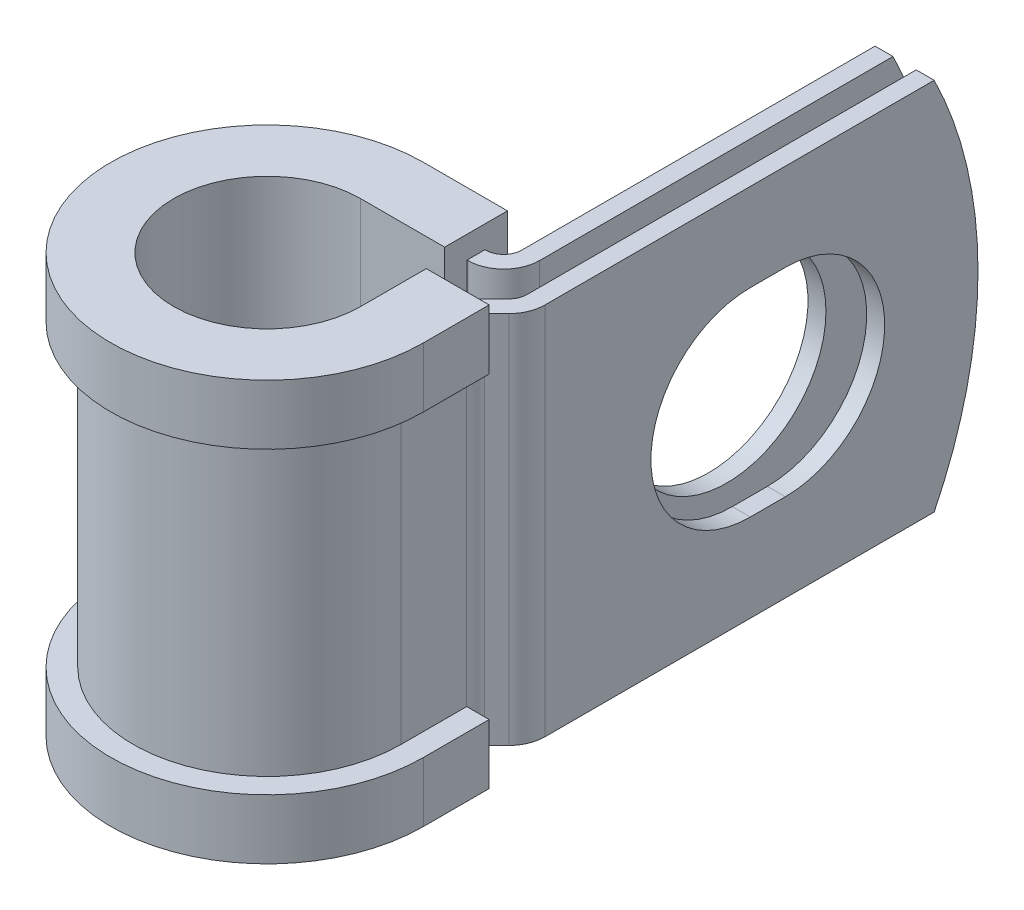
ISO-10303-21;
HEADER;
FILE_DESCRIPTION(('STEP AP214'),'2;1');
FILE_NAME('part.step','',(''),(''),'','','');
FILE_SCHEMA(('AUTOMOTIVE_DESIGN { 1 0 10303 214 1 1 1 1 }'));
ENDSEC;
DATA;
#1=APPLICATION_CONTEXT('core data for automotive mechanical design processes');
#2=APPLICATION_PROTOCOL_DEFINITION('international standard','automotive_design',2000,#1);
#3=PRODUCT_CONTEXT('',#1,'mechanical');
#4=PRODUCT('Part','Part','',(#3));
#5=PRODUCT_RELATED_PRODUCT_CATEGORY('part','',(#4));
#6=PRODUCT_DEFINITION_FORMATION('','',#4);
#7=PRODUCT_DEFINITION_CONTEXT('part definition',#1,'design');
#8=PRODUCT_DEFINITION('design','',#6,#7);
#9=PRODUCT_DEFINITION_SHAPE('','',#8);
#10=(LENGTH_UNIT() NAMED_UNIT(*) SI_UNIT(.MILLI.,.METRE.));
#11=(NAMED_UNIT(*) PLANE_ANGLE_UNIT() SI_UNIT($,.RADIAN.));
#12=(NAMED_UNIT(*) SI_UNIT($,.STERADIAN.) SOLID_ANGLE_UNIT());
#13=UNCERTAINTY_MEASURE_WITH_UNIT(LENGTH_MEASURE(1.E-05),#10,'distance_accuracy_value','');
#14=(GEOMETRIC_REPRESENTATION_CONTEXT(3) GLOBAL_UNCERTAINTY_ASSIGNED_CONTEXT((#13)) GLOBAL_UNIT_ASSIGNED_CONTEXT((#10,
#11,#12)) REPRESENTATION_CONTEXT('',''));
#15=CARTESIAN_POINT('',(0.,0.,0.));
#16=DIRECTION('',(0.,0.,1.));
#17=DIRECTION('',(1.,0.,0.));
#18=AXIS2_PLACEMENT_3D('',#15,#16,#17);
#19=CARTESIAN_POINT('',(8.55226980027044,-12.7,-7.874));
#20=DIRECTION('',(0.,1.,0.));
#21=DIRECTION('',(1.,0.,0.));
#22=AXIS2_PLACEMENT_3D('',#19,#20,#21);
#23=PLANE('',#22);
#24=DIRECTION('',(0.,0.,-1.));
#25=VECTOR('',#24,1.);
#26=CARTESIAN_POINT('',(5.70746980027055,-12.7,-7.874));
#27=LINE('',#26,#25);
#28=CARTESIAN_POINT('',(5.70746980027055,-12.7,-7.874));
#29=VERTEX_POINT('',#28);
#30=CARTESIAN_POINT('',(5.70746980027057,-12.7,-9.0932));
#31=VERTEX_POINT('',#30);
#32=EDGE_CURVE('E524',#29,#31,#27,.T.);
#33=ORIENTED_EDGE('',*,*,#32,.T.);
#34=DIRECTION('',(1.,0.,0.));
#35=VECTOR('',#34,1.);
#36=CARTESIAN_POINT('',(0.,-12.7,-9.0932));
#37=LINE('',#36,#35);
#38=CARTESIAN_POINT('',(5.75826980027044,-12.7,-9.0932));
#39=VERTEX_POINT('',#38);
#40=EDGE_CURVE('E411',#39,#31,#37,.F.);
#41=ORIENTED_EDGE('',*,*,#40,.F.);
#42=CARTESIAN_POINT('',(5.75826980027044,-12.7,-10.3124));
#43=DIRECTION('',(0.,1.,0.));
#44=DIRECTION('',(1.,0.,0.));
#45=AXIS2_PLACEMENT_3D('',#42,#43,#44);
#46=CIRCLE('',#45,1.2192);
#47=CARTESIAN_POINT('',(6.97746980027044,-12.7,-10.3124));
#48=VERTEX_POINT('',#47);
#49=EDGE_CURVE('E409',#48,#39,#46,.F.);
#50=ORIENTED_EDGE('',*,*,#49,.F.);
#51=DIRECTION('',(0.,0.,-1.));
#52=VECTOR('',#51,1.);
#53=CARTESIAN_POINT('',(6.97746980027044,-12.7,-37.2872));
#54=LINE('',#53,#52);
#55=CARTESIAN_POINT('',(6.97746980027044,-12.7,-34.3098683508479));
#56=VERTEX_POINT('',#55);
#57=EDGE_CURVE('E407',#56,#48,#54,.F.);
#58=ORIENTED_EDGE('',*,*,#57,.F.);
#59=DIRECTION('',(-1.,0.,0.));
#60=VECTOR('',#59,1.);
#61=CARTESIAN_POINT('',(10.9906698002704,-12.7,-34.3098683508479));
#62=LINE('',#61,#60);
#63=CARTESIAN_POINT('',(8.19666980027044,-12.7,-34.3098683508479));
#64=VERTEX_POINT('',#63);
#65=EDGE_CURVE('E12',#64,#56,#62,.T.);
#66=ORIENTED_EDGE('',*,*,#65,.F.);
#67=DIRECTION('',(0.,0.,1.));
#68=VECTOR('',#67,1.);
#69=CARTESIAN_POINT('',(8.19666980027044,-12.7,-37.2872));
#70=LINE('',#69,#68);
#71=CARTESIAN_POINT('',(8.19666980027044,-12.7,-10.3124));
#72=VERTEX_POINT('',#71);
#73=EDGE_CURVE('E405',#64,#72,#70,.T.);
#74=ORIENTED_EDGE('',*,*,#73,.T.);
#75=CARTESIAN_POINT('',(5.75826980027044,-12.7,-10.3124));
#76=DIRECTION('',(0.,-1.,0.));
#77=DIRECTION('',(0.,0.,1.));
#78=AXIS2_PLACEMENT_3D('',#75,#76,#77);
#79=CIRCLE('',#78,2.4384);
#80=CARTESIAN_POINT('',(5.75826980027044,-12.7,-7.874));
#81=VERTEX_POINT('',#80);
#82=EDGE_CURVE('E402',#72,#81,#79,.T.);
#83=ORIENTED_EDGE('',*,*,#82,.T.);
#84=DIRECTION('',(-1.,0.,0.));
#85=VECTOR('',#84,1.);
#86=CARTESIAN_POINT('',(0.,-12.7,-7.874));
#87=LINE('',#86,#85);
#88=EDGE_CURVE('E399',#81,#29,#87,.T.);
#89=ORIENTED_EDGE('',*,*,#88,.T.);
#90=EDGE_LOOP('',(#33,#41,#50,#58,#66,#74,#83,#89));
#91=FACE_BOUND('',#90,.T.);
#92=ADVANCED_FACE('F55',(#91),#23,.F.);
#93=CARTESIAN_POINT('',(8.55226980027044,12.7,-7.874));
#94=DIRECTION('',(0.,1.,0.));
#95=DIRECTION('',(1.,0.,0.));
#96=AXIS2_PLACEMENT_3D('',#93,#94,#95);
#97=PLANE('',#96);
#98=DIRECTION('',(1.,0.,0.));
#99=VECTOR('',#98,1.);
#100=CARTESIAN_POINT('',(0.,12.7,-9.0932));
#101=LINE('',#100,#99);
#102=CARTESIAN_POINT('',(5.75826980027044,12.7,-9.0932));
#103=VERTEX_POINT('',#102);
#104=CARTESIAN_POINT('',(5.70746980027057,12.7,-9.0932));
#105=VERTEX_POINT('',#104);
#106=EDGE_CURVE('E369',#103,#105,#101,.F.);
#107=ORIENTED_EDGE('',*,*,#106,.T.);
#108=DIRECTION('',(0.,0.,1.));
#109=VECTOR('',#108,1.);
#110=CARTESIAN_POINT('',(5.70746980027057,12.7,-9.0932));
#111=LINE('',#110,#109);
#112=CARTESIAN_POINT('',(5.70746980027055,12.7,-7.874));
#113=VERTEX_POINT('',#112);
#114=EDGE_CURVE('E518',#105,#113,#111,.T.);
#115=ORIENTED_EDGE('',*,*,#114,.T.);
#116=DIRECTION('',(-1.,0.,0.));
#117=VECTOR('',#116,1.);
#118=CARTESIAN_POINT('',(0.,12.7,-7.874));
#119=LINE('',#118,#117);
#120=CARTESIAN_POINT('',(5.75826980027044,12.7,-7.874));
#121=VERTEX_POINT('',#120);
#122=EDGE_CURVE('E626',#121,#113,#119,.T.);
#123=ORIENTED_EDGE('',*,*,#122,.F.);
#124=CARTESIAN_POINT('',(5.75826980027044,12.7,-10.3124));
#125=DIRECTION('',(0.,-1.,0.));
#126=DIRECTION('',(0.,0.,1.));
#127=AXIS2_PLACEMENT_3D('',#124,#125,#126);
#128=CIRCLE('',#127,2.4384);
#129=CARTESIAN_POINT('',(8.19666980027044,12.7,-10.3124));
#130=VERTEX_POINT('',#129);
#131=EDGE_CURVE('E371',#130,#121,#128,.T.);
#132=ORIENTED_EDGE('',*,*,#131,.F.);
#133=DIRECTION('',(0.,0.,1.));
#134=VECTOR('',#133,1.);
#135=CARTESIAN_POINT('',(8.19666980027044,12.7,-37.2872));
#136=LINE('',#135,#134);
#137=CARTESIAN_POINT('',(8.19666980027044,12.7,-34.3098683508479));
#138=VERTEX_POINT('',#137);
#139=EDGE_CURVE('E362',#138,#130,#136,.T.);
#140=ORIENTED_EDGE('',*,*,#139,.F.);
#141=DIRECTION('',(-1.,0.,0.));
#142=VECTOR('',#141,1.);
#143=CARTESIAN_POINT('',(10.9906698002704,12.7,-34.3098683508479));
#144=LINE('',#143,#142);
#145=CARTESIAN_POINT('',(6.97746980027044,12.7,-34.3098683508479));
#146=VERTEX_POINT('',#145);
#147=EDGE_CURVE('E63',#138,#146,#144,.T.);
#148=ORIENTED_EDGE('',*,*,#147,.T.);
#149=DIRECTION('',(0.,0.,-1.));
#150=VECTOR('',#149,1.);
#151=CARTESIAN_POINT('',(6.97746980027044,12.7,-37.2872));
#152=LINE('',#151,#150);
#153=CARTESIAN_POINT('',(6.97746980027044,12.7,-10.3124));
#154=VERTEX_POINT('',#153);
#155=EDGE_CURVE('E359',#146,#154,#152,.F.);
#156=ORIENTED_EDGE('',*,*,#155,.T.);
#157=CARTESIAN_POINT('',(5.75826980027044,12.7,-10.3124));
#158=DIRECTION('',(0.,1.,0.));
#159=DIRECTION('',(1.,0.,0.));
#160=AXIS2_PLACEMENT_3D('',#157,#158,#159);
#161=CIRCLE('',#160,1.2192);
#162=EDGE_CURVE('E367',#154,#103,#161,.F.);
#163=ORIENTED_EDGE('',*,*,#162,.T.);
#164=EDGE_LOOP('',(#107,#115,#123,#132,#140,#148,#156,#163));
#165=FACE_BOUND('',#164,.T.);
#166=ADVANCED_FACE('F358',(#165),#97,.T.);
#167=CARTESIAN_POINT('',(0.,12.7,-7.874));
#168=DIRECTION('',(0.,0.,1.));
#169=DIRECTION('',(1.,0.,0.));
#170=AXIS2_PLACEMENT_3D('',#167,#168,#169);
#171=PLANE('',#170);
#172=ORIENTED_EDGE('',*,*,#122,.T.);
#173=DIRECTION('',(0.,-1.,0.));
#174=VECTOR('',#173,1.);
#175=CARTESIAN_POINT('',(5.70746980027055,12.7,-7.874));
#176=LINE('',#175,#174);
#177=EDGE_CURVE('E521',#113,#29,#176,.T.);
#178=ORIENTED_EDGE('',*,*,#177,.T.);
#179=ORIENTED_EDGE('',*,*,#88,.F.);
#180=DIRECTION('',(0.,-1.,0.));
#181=VECTOR('',#180,1.);
#182=CARTESIAN_POINT('',(5.75826980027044,12.7,-7.874));
#183=LINE('',#182,#181);
#184=EDGE_CURVE('E345',#121,#81,#183,.T.);
#185=ORIENTED_EDGE('',*,*,#184,.F.);
#186=EDGE_LOOP('',(#172,#178,#179,#185));
#187=FACE_BOUND('',#186,.T.);
#188=ADVANCED_FACE('F636',(#187),#171,.T.);
#189=CARTESIAN_POINT('',(10.9906698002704,12.7,-7.874));
#190=DIRECTION('',(-1.,0.,0.));
#191=DIRECTION('',(0.,0.,1.));
#192=AXIS2_PLACEMENT_3D('',#189,#190,#191);
#193=PLANE('',#192);
#194=CARTESIAN_POINT('',(10.9906698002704,0.,-24.2061999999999));
#195=DIRECTION('',(1.,0.,0.));
#196=DIRECTION('',(0.,0.,-1.));
#197=AXIS2_PLACEMENT_3D('',#194,#195,#196);
#198=CIRCLE('',#197,6.7437);
#199=CARTESIAN_POINT('',(10.9906698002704,-6.7437,-24.2062000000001));
#200=VERTEX_POINT('',#199);
#201=CARTESIAN_POINT('',(10.9906698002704,6.7437,-24.2062000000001));
#202=VERTEX_POINT('',#201);
#203=EDGE_CURVE('E581',#200,#202,#198,.T.);
#204=ORIENTED_EDGE('',*,*,#203,.F.);
#205=DIRECTION('',(0.,0.,-1.));
#206=VECTOR('',#205,1.);
#207=CARTESIAN_POINT('',(10.9906698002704,-6.7437,-21.8185999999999));
#208=LINE('',#207,#206);
#209=CARTESIAN_POINT('',(10.9906698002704,-6.7437,-21.8185999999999));
#210=VERTEX_POINT('',#209);
#211=EDGE_CURVE('E584',#210,#200,#208,.T.);
#212=ORIENTED_EDGE('',*,*,#211,.F.);
#213=CARTESIAN_POINT('',(10.9906698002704,0.,-21.8185999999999));
#214=DIRECTION('',(1.,0.,0.));
#215=DIRECTION('',(0.,0.,-1.));
#216=AXIS2_PLACEMENT_3D('',#213,#214,#215);
#217=CIRCLE('',#216,6.7437);
#218=CARTESIAN_POINT('',(10.9906698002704,6.7437,-21.8185999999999));
#219=VERTEX_POINT('',#218);
#220=EDGE_CURVE('E577',#219,#210,#217,.T.);
#221=ORIENTED_EDGE('',*,*,#220,.F.);
#222=DIRECTION('',(0.,0.,1.));
#223=VECTOR('',#222,1.);
#224=CARTESIAN_POINT('',(10.9906698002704,6.7437,-21.8185999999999));
#225=LINE('',#224,#223);
#226=EDGE_CURVE('E578',#202,#219,#225,.T.);
#227=ORIENTED_EDGE('',*,*,#226,.F.);
#228=EDGE_LOOP('',(#204,#212,#221,#227));
#229=FACE_BOUND('',#228,.T.);
#230=DIRECTION('',(0.,0.,-1.));
#231=VECTOR('',#230,1.);
#232=CARTESIAN_POINT('',(10.9906698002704,-12.7,-7.874));
#233=LINE('',#232,#231);
#234=CARTESIAN_POINT('',(10.9906698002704,-12.7,-7.874));
#235=VERTEX_POINT('',#234);
#236=CARTESIAN_POINT('',(10.9906698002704,-12.7,-34.3098683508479));
#237=VERTEX_POINT('',#236);
#238=EDGE_CURVE('E383',#235,#237,#233,.T.);
#239=ORIENTED_EDGE('',*,*,#238,.T.);
#240=CARTESIAN_POINT('',(10.9906698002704,0.,-8.7122));
#241=DIRECTION('',(-1.,0.,0.));
#242=DIRECTION('',(0.,0.,1.));
#243=AXIS2_PLACEMENT_3D('',#240,#241,#242);
#244=CIRCLE('',#243,28.575);
#245=CARTESIAN_POINT('',(10.9906698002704,12.7,-34.3098683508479));
#246=VERTEX_POINT('',#245);
#247=EDGE_CURVE('E569',#246,#237,#244,.T.);
#248=ORIENTED_EDGE('',*,*,#247,.F.);
#249=DIRECTION('',(0.,0.,-1.));
#250=VECTOR('',#249,1.);
#251=CARTESIAN_POINT('',(10.9906698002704,12.7,-7.874));
#252=LINE('',#251,#250);
#253=CARTESIAN_POINT('',(10.9906698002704,12.7,-7.874));
#254=VERTEX_POINT('',#253);
#255=EDGE_CURVE('E420',#254,#246,#252,.T.);
#256=ORIENTED_EDGE('',*,*,#255,.F.);
#257=DIRECTION('',(0.,-1.,0.));
#258=VECTOR('',#257,1.);
#259=CARTESIAN_POINT('',(10.9906698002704,12.7,-7.874));
#260=LINE('',#259,#258);
#261=EDGE_CURVE('E382',#254,#235,#260,.T.);
#262=ORIENTED_EDGE('',*,*,#261,.T.);
#263=EDGE_LOOP('',(#239,#248,#256,#262));
#264=FACE_BOUND('',#263,.T.);
#265=ADVANCED_FACE('F57',(#229,#264),#193,.F.);
#266=CARTESIAN_POINT('',(9.77146980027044,12.7,-7.874));
#267=DIRECTION('',(-1.,0.,0.));
#268=DIRECTION('',(0.,0.,1.));
#269=AXIS2_PLACEMENT_3D('',#266,#267,#268);
#270=PLANE('',#269);
#271=DIRECTION('',(0.,0.,-1.));
#272=VECTOR('',#271,1.);
#273=CARTESIAN_POINT('',(9.77146980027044,-6.7437,-21.8185999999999));
#274=LINE('',#273,#272);
#275=CARTESIAN_POINT('',(9.77146980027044,-6.7437,-21.8185999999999));
#276=VERTEX_POINT('',#275);
#277=CARTESIAN_POINT('',(9.77146980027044,-6.7437,-24.2062000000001));
#278=VERTEX_POINT('',#277);
#279=EDGE_CURVE('E580',#276,#278,#274,.T.);
#280=ORIENTED_EDGE('',*,*,#279,.T.);
#281=CARTESIAN_POINT('',(9.77146980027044,0.,-24.2061999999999));
#282=DIRECTION('',(-1.,0.,0.));
#283=DIRECTION('',(0.,0.,1.));
#284=AXIS2_PLACEMENT_3D('',#281,#282,#283);
#285=CIRCLE('',#284,6.7437);
#286=CARTESIAN_POINT('',(9.77146980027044,6.7437,-24.2062000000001));
#287=VERTEX_POINT('',#286);
#288=EDGE_CURVE('E601',#278,#287,#285,.F.);
#289=ORIENTED_EDGE('',*,*,#288,.T.);
#290=DIRECTION('',(0.,0.,1.));
#291=VECTOR('',#290,1.);
#292=CARTESIAN_POINT('',(9.77146980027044,6.7437,-21.8185999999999));
#293=LINE('',#292,#291);
#294=CARTESIAN_POINT('',(9.77146980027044,6.7437,-21.8185999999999));
#295=VERTEX_POINT('',#294);
#296=EDGE_CURVE('E597',#287,#295,#293,.T.);
#297=ORIENTED_EDGE('',*,*,#296,.T.);
#298=CARTESIAN_POINT('',(9.77146980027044,0.,-21.8185999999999));
#299=DIRECTION('',(-1.,0.,0.));
#300=DIRECTION('',(0.,0.,1.));
#301=AXIS2_PLACEMENT_3D('',#298,#299,#300);
#302=CIRCLE('',#301,6.7437);
#303=EDGE_CURVE('E592',#295,#276,#302,.F.);
#304=ORIENTED_EDGE('',*,*,#303,.T.);
#305=EDGE_LOOP('',(#280,#289,#297,#304));
#306=FACE_BOUND('',#305,.T.);
#307=CARTESIAN_POINT('',(9.77146980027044,0.,-8.7122));
#308=DIRECTION('',(-1.,0.,0.));
#309=DIRECTION('',(0.,0.,1.));
#310=AXIS2_PLACEMENT_3D('',#307,#308,#309);
#311=CIRCLE('',#310,28.575);
#312=CARTESIAN_POINT('',(9.77146980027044,12.7,-34.3098683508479));
#313=VERTEX_POINT('',#312);
#314=CARTESIAN_POINT('',(9.77146980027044,-12.7,-34.3098683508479));
#315=VERTEX_POINT('',#314);
#316=EDGE_CURVE('E77',#313,#315,#311,.T.);
#317=ORIENTED_EDGE('',*,*,#316,.T.);
#318=DIRECTION('',(0.,0.,-1.));
#319=VECTOR('',#318,1.);
#320=CARTESIAN_POINT('',(9.77146980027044,-12.7,-7.874));
#321=LINE('',#320,#319);
#322=CARTESIAN_POINT('',(9.77146980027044,-12.7,-7.874));
#323=VERTEX_POINT('',#322);
#324=EDGE_CURVE('E386',#323,#315,#321,.T.);
#325=ORIENTED_EDGE('',*,*,#324,.F.);
#326=DIRECTION('',(0.,-1.,0.));
#327=VECTOR('',#326,1.);
#328=CARTESIAN_POINT('',(9.77146980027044,12.7,-7.874));
#329=LINE('',#328,#327);
#330=CARTESIAN_POINT('',(9.77146980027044,12.7,-7.874));
#331=VERTEX_POINT('',#330);
#332=EDGE_CURVE('E353',#331,#323,#329,.T.);
#333=ORIENTED_EDGE('',*,*,#332,.F.);
#334=DIRECTION('',(0.,0.,-1.));
#335=VECTOR('',#334,1.);
#336=CARTESIAN_POINT('',(9.77146980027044,12.7,-7.874));
#337=LINE('',#336,#335);
#338=EDGE_CURVE('E616',#331,#313,#337,.T.);
#339=ORIENTED_EDGE('',*,*,#338,.T.);
#340=EDGE_LOOP('',(#317,#325,#333,#339));
#341=FACE_BOUND('',#340,.T.);
#342=ADVANCED_FACE('F690',(#306,#341),#270,.T.);
#343=CARTESIAN_POINT('',(8.19666980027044,12.7,-37.2872));
#344=DIRECTION('',(1.,0.,0.));
#345=DIRECTION('',(0.,0.,-1.));
#346=AXIS2_PLACEMENT_3D('',#343,#344,#345);
#347=PLANE('',#346);
#348=CARTESIAN_POINT('',(8.19666980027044,0.,-23.0124));
#349=DIRECTION('',(1.,0.,0.));
#350=DIRECTION('',(0.,0.,-1.));
#351=AXIS2_PLACEMENT_3D('',#348,#349,#350);
#352=CIRCLE('',#351,6.7437);
#353=CARTESIAN_POINT('',(8.19666980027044,0.,-29.7561));
#354=VERTEX_POINT('',#353);
#355=EDGE_CURVE('E387',#354,#354,#352,.F.);
#356=ORIENTED_EDGE('',*,*,#355,.T.);
#357=EDGE_LOOP('',(#356));
#358=FACE_BOUND('',#357,.T.);
#359=ORIENTED_EDGE('',*,*,#73,.F.);
#360=CARTESIAN_POINT('',(8.19666980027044,0.,-8.7122));
#361=DIRECTION('',(1.,0.,0.));
#362=DIRECTION('',(0.,0.,-1.));
#363=AXIS2_PLACEMENT_3D('',#360,#361,#362);
#364=CIRCLE('',#363,28.575);
#365=EDGE_CURVE('E574',#64,#138,#364,.T.);
#366=ORIENTED_EDGE('',*,*,#365,.T.);
#367=ORIENTED_EDGE('',*,*,#139,.T.);
#368=DIRECTION('',(0.,-1.,0.));
#369=VECTOR('',#368,1.);
#370=CARTESIAN_POINT('',(8.19666980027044,12.7,-10.3124));
#371=LINE('',#370,#369);
#372=EDGE_CURVE('E342',#130,#72,#371,.T.);
#373=ORIENTED_EDGE('',*,*,#372,.T.);
#374=EDGE_LOOP('',(#359,#366,#367,#373));
#375=FACE_BOUND('',#374,.T.);
#376=ADVANCED_FACE('F642',(#358,#375),#347,.T.);
#377=CARTESIAN_POINT('',(6.97746980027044,12.7,-37.2872));
#378=DIRECTION('',(1.,0.,0.));
#379=DIRECTION('',(0.,0.,-1.));
#380=AXIS2_PLACEMENT_3D('',#377,#378,#379);
#381=PLANE('',#380);
#382=CARTESIAN_POINT('',(6.97746980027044,0.,-23.0124));
#383=DIRECTION('',(-1.,0.,0.));
#384=DIRECTION('',(0.,0.,1.));
#385=AXIS2_PLACEMENT_3D('',#382,#383,#384);
#386=CIRCLE('',#385,6.7437);
#387=CARTESIAN_POINT('',(6.97746980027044,0.,-16.2687));
#388=VERTEX_POINT('',#387);
#389=EDGE_CURVE('E609',#388,#388,#386,.T.);
#390=ORIENTED_EDGE('',*,*,#389,.F.);
#391=EDGE_LOOP('',(#390));
#392=FACE_BOUND('',#391,.T.);
#393=CARTESIAN_POINT('',(6.97746980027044,0.,-8.7122));
#394=DIRECTION('',(-1.,0.,0.));
#395=DIRECTION('',(0.,0.,1.));
#396=AXIS2_PLACEMENT_3D('',#393,#394,#395);
#397=CIRCLE('',#396,28.575);
#398=EDGE_CURVE('E69',#146,#56,#397,.T.);
#399=ORIENTED_EDGE('',*,*,#398,.T.);
#400=ORIENTED_EDGE('',*,*,#57,.T.);
#401=DIRECTION('',(0.,-1.,0.));
#402=VECTOR('',#401,1.);
#403=CARTESIAN_POINT('',(6.97746980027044,12.7,-10.3124));
#404=LINE('',#403,#402);
#405=EDGE_CURVE('E339',#154,#48,#404,.T.);
#406=ORIENTED_EDGE('',*,*,#405,.F.);
#407=ORIENTED_EDGE('',*,*,#155,.F.);
#408=EDGE_LOOP('',(#399,#400,#406,#407));
#409=FACE_BOUND('',#408,.T.);
#410=ADVANCED_FACE('F365',(#392,#409),#381,.F.);
#411=CARTESIAN_POINT('',(10.3124,-12.7,-4.46150267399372));
#412=DIRECTION('',(0.,1.,0.));
#413=DIRECTION('',(1.,0.,0.));
#414=AXIS2_PLACEMENT_3D('',#411,#412,#413);
#415=CIRCLE('',#414,1.2192);
#416=CARTESIAN_POINT('',(9.0932,-12.7,-4.46150267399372));
#417=VERTEX_POINT('',#416);
#418=CARTESIAN_POINT('',(9.45029541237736,-12.7,-5.32360726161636));
#419=VERTEX_POINT('',#418);
#420=EDGE_CURVE('E414',#417,#419,#415,.F.);
#421=ORIENTED_EDGE('',*,*,#420,.F.);
#422=DIRECTION('',(1.,0.,0.));
#423=VECTOR('',#422,1.);
#424=CARTESIAN_POINT('',(7.874,-12.7,-4.46150267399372));
#425=LINE('',#424,#423);
#426=CARTESIAN_POINT('',(7.874,-12.7,-4.46150267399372));
#427=VERTEX_POINT('',#426);
#428=EDGE_CURVE('E452',#427,#417,#425,.T.);
#429=ORIENTED_EDGE('',*,*,#428,.F.);
#430=CARTESIAN_POINT('',(10.3124,-12.7,-4.46150267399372));
#431=DIRECTION('',(0.,-1.,0.));
#432=DIRECTION('',(0.,0.,1.));
#433=AXIS2_PLACEMENT_3D('',#430,#431,#432);
#434=CIRCLE('',#433,2.4384);
#435=CARTESIAN_POINT('',(8.58819082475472,-12.7,-6.185711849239));
#436=VERTEX_POINT('',#435);
#437=EDGE_CURVE('E396',#427,#436,#434,.T.);
#438=ORIENTED_EDGE('',*,*,#437,.T.);
#439=DIRECTION('',(0.707106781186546,0.,-0.707106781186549));
#440=VECTOR('',#439,1.);
#441=CARTESIAN_POINT('',(8.58819082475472,-12.7,-6.185711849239));
#442=LINE('',#441,#440);
#443=CARTESIAN_POINT('',(9.41437438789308,-12.7,-7.01189541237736));
#444=VERTEX_POINT('',#443);
#445=EDGE_CURVE('E393',#436,#444,#442,.T.);
#446=ORIENTED_EDGE('',*,*,#445,.T.);
#447=CARTESIAN_POINT('',(8.55226980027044,-12.7,-7.874));
#448=DIRECTION('',(0.,1.,0.));
#449=DIRECTION('',(0.,0.,1.));
#450=AXIS2_PLACEMENT_3D('',#447,#448,#449);
#451=CIRCLE('',#450,1.2192);
#452=EDGE_CURVE('E390',#444,#323,#451,.T.);
#453=ORIENTED_EDGE('',*,*,#452,.T.);
#454=ORIENTED_EDGE('',*,*,#324,.T.);
#455=DIRECTION('',(-1.,0.,0.));
#456=VECTOR('',#455,1.);
#457=CARTESIAN_POINT('',(10.9906698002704,-12.7,-34.3098683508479));
#458=LINE('',#457,#456);
#459=EDGE_CURVE('E567',#237,#315,#458,.T.);
#460=ORIENTED_EDGE('',*,*,#459,.F.);
#461=ORIENTED_EDGE('',*,*,#238,.F.);
#462=CARTESIAN_POINT('',(8.55226980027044,-12.7,-7.874));
#463=DIRECTION('',(0.,1.,0.));
#464=DIRECTION('',(1.,0.,0.));
#465=AXIS2_PLACEMENT_3D('',#462,#463,#464);
#466=CIRCLE('',#465,2.4384);
#467=CARTESIAN_POINT('',(10.2764789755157,-12.7,-6.14979082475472));
#468=VERTEX_POINT('',#467);
#469=EDGE_CURVE('E418',#468,#235,#466,.T.);
#470=ORIENTED_EDGE('',*,*,#469,.F.);
#471=DIRECTION('',(0.707106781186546,0.,-0.707106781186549));
#472=VECTOR('',#471,1.);
#473=CARTESIAN_POINT('',(9.45029541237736,-12.7,-5.32360726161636));
#474=LINE('',#473,#472);
#475=EDGE_CURVE('E416',#419,#468,#474,.T.);
#476=ORIENTED_EDGE('',*,*,#475,.F.);
#477=EDGE_LOOP('',(#421,#429,#438,#446,#453,#454,#460,#461,#470,#476));
#478=FACE_BOUND('',#477,.T.);
#479=ADVANCED_FACE('F676',(#478),#23,.F.);
#480=DIRECTION('',(-1.,0.,0.));
#481=VECTOR('',#480,1.);
#482=CARTESIAN_POINT('',(9.0932,12.7,-4.46150267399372));
#483=LINE('',#482,#481);
#484=CARTESIAN_POINT('',(9.0932,12.7,-4.46150267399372));
#485=VERTEX_POINT('',#484);
#486=CARTESIAN_POINT('',(7.874,12.7,-4.46150267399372));
#487=VERTEX_POINT('',#486);
#488=EDGE_CURVE('E441',#485,#487,#483,.T.);
#489=ORIENTED_EDGE('',*,*,#488,.F.);
#490=CARTESIAN_POINT('',(10.3124,12.7,-4.46150267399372));
#491=DIRECTION('',(0.,1.,0.));
#492=DIRECTION('',(1.,0.,0.));
#493=AXIS2_PLACEMENT_3D('',#490,#491,#492);
#494=CIRCLE('',#493,1.2192);
#495=CARTESIAN_POINT('',(9.45029541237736,12.7,-5.32360726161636));
#496=VERTEX_POINT('',#495);
#497=EDGE_CURVE('E376',#485,#496,#494,.F.);
#498=ORIENTED_EDGE('',*,*,#497,.T.);
#499=DIRECTION('',(0.707106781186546,0.,-0.707106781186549));
#500=VECTOR('',#499,1.);
#501=CARTESIAN_POINT('',(9.45029541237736,12.7,-5.32360726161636));
#502=LINE('',#501,#500);
#503=CARTESIAN_POINT('',(10.2764789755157,12.7,-6.14979082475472));
#504=VERTEX_POINT('',#503);
#505=EDGE_CURVE('E378',#496,#504,#502,.T.);
#506=ORIENTED_EDGE('',*,*,#505,.T.);
#507=CARTESIAN_POINT('',(8.55226980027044,12.7,-7.874));
#508=DIRECTION('',(0.,1.,0.));
#509=DIRECTION('',(1.,0.,0.));
#510=AXIS2_PLACEMENT_3D('',#507,#508,#509);
#511=CIRCLE('',#510,2.4384);
#512=EDGE_CURVE('E380',#504,#254,#511,.T.);
#513=ORIENTED_EDGE('',*,*,#512,.T.);
#514=ORIENTED_EDGE('',*,*,#255,.T.);
#515=DIRECTION('',(-1.,0.,0.));
#516=VECTOR('',#515,1.);
#517=CARTESIAN_POINT('',(10.9906698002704,12.7,-34.3098683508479));
#518=LINE('',#517,#516);
#519=EDGE_CURVE('E571',#246,#313,#518,.T.);
#520=ORIENTED_EDGE('',*,*,#519,.T.);
#521=ORIENTED_EDGE('',*,*,#338,.F.);
#522=CARTESIAN_POINT('',(8.55226980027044,12.7,-7.874));
#523=DIRECTION('',(0.,1.,0.));
#524=DIRECTION('',(0.,0.,1.));
#525=AXIS2_PLACEMENT_3D('',#522,#523,#524);
#526=CIRCLE('',#525,1.2192);
#527=CARTESIAN_POINT('',(9.41437438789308,12.7,-7.01189541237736));
#528=VERTEX_POINT('',#527);
#529=EDGE_CURVE('E619',#528,#331,#526,.T.);
#530=ORIENTED_EDGE('',*,*,#529,.F.);
#531=DIRECTION('',(0.707106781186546,0.,-0.707106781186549));
#532=VECTOR('',#531,1.);
#533=CARTESIAN_POINT('',(8.58819082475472,12.7,-6.185711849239));
#534=LINE('',#533,#532);
#535=CARTESIAN_POINT('',(8.58819082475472,12.7,-6.185711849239));
#536=VERTEX_POINT('',#535);
#537=EDGE_CURVE('E622',#536,#528,#534,.T.);
#538=ORIENTED_EDGE('',*,*,#537,.F.);
#539=CARTESIAN_POINT('',(10.3124,12.7,-4.46150267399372));
#540=DIRECTION('',(0.,-1.,0.));
#541=DIRECTION('',(0.,0.,1.));
#542=AXIS2_PLACEMENT_3D('',#539,#540,#541);
#543=CIRCLE('',#542,2.4384);
#544=EDGE_CURVE('E451',#487,#536,#543,.T.);
#545=ORIENTED_EDGE('',*,*,#544,.F.);
#546=EDGE_LOOP('',(#489,#498,#506,#513,#514,#520,#521,#530,#538,#545));
#547=FACE_BOUND('',#546,.T.);
#548=ADVANCED_FACE('F448',(#547),#97,.T.);
#549=CARTESIAN_POINT('',(8.55226980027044,12.7,-7.874));
#550=DIRECTION('',(0.,-1.,0.));
#551=DIRECTION('',(0.,0.,-1.));
#552=AXIS2_PLACEMENT_3D('',#549,#550,#551);
#553=CYLINDRICAL_SURFACE('',#552,1.2192);
#554=ORIENTED_EDGE('',*,*,#452,.F.);
#555=DIRECTION('',(0.,-1.,0.));
#556=VECTOR('',#555,1.);
#557=CARTESIAN_POINT('',(9.41437438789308,12.7,-7.01189541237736));
#558=LINE('',#557,#556);
#559=EDGE_CURVE('E351',#528,#444,#558,.T.);
#560=ORIENTED_EDGE('',*,*,#559,.F.);
#561=ORIENTED_EDGE('',*,*,#529,.T.);
#562=ORIENTED_EDGE('',*,*,#332,.T.);
#563=EDGE_LOOP('',(#554,#560,#561,#562));
#564=FACE_BOUND('',#563,.T.);
#565=ADVANCED_FACE('F686',(#564),#553,.F.);
#566=CARTESIAN_POINT('',(8.58819082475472,12.7,-6.185711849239));
#567=DIRECTION('',(-0.707106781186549,0.,-0.707106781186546));
#568=DIRECTION('',(-0.707106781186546,0.,0.707106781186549));
#569=AXIS2_PLACEMENT_3D('',#566,#567,#568);
#570=PLANE('',#569);
#571=ORIENTED_EDGE('',*,*,#445,.F.);
#572=DIRECTION('',(0.,-1.,0.));
#573=VECTOR('',#572,1.);
#574=CARTESIAN_POINT('',(8.58819082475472,12.7,-6.185711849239));
#575=LINE('',#574,#573);
#576=EDGE_CURVE('E349',#536,#436,#575,.T.);
#577=ORIENTED_EDGE('',*,*,#576,.F.);
#578=ORIENTED_EDGE('',*,*,#537,.T.);
#579=ORIENTED_EDGE('',*,*,#559,.T.);
#580=EDGE_LOOP('',(#571,#577,#578,#579));
#581=FACE_BOUND('',#580,.T.);
#582=ADVANCED_FACE('F681',(#581),#570,.T.);
#583=CARTESIAN_POINT('',(10.3124,12.7,-4.46150267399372));
#584=DIRECTION('',(0.,-1.,0.));
#585=DIRECTION('',(0.,0.,-1.));
#586=AXIS2_PLACEMENT_3D('',#583,#584,#585);
#587=CYLINDRICAL_SURFACE('',#586,2.4384);
#588=ORIENTED_EDGE('',*,*,#437,.F.);
#589=DIRECTION('',(0.,-1.,0.));
#590=VECTOR('',#589,1.);
#591=CARTESIAN_POINT('',(7.874,12.7,-4.46150267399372));
#592=LINE('',#591,#590);
#593=EDGE_CURVE('E347',#487,#427,#592,.T.);
#594=ORIENTED_EDGE('',*,*,#593,.F.);
#595=ORIENTED_EDGE('',*,*,#544,.T.);
#596=ORIENTED_EDGE('',*,*,#576,.T.);
#597=EDGE_LOOP('',(#588,#594,#595,#596));
#598=FACE_BOUND('',#597,.T.);
#599=ADVANCED_FACE('F678',(#598),#587,.T.);
#600=CARTESIAN_POINT('',(5.75826980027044,12.7,-10.3124));
#601=DIRECTION('',(0.,-1.,0.));
#602=DIRECTION('',(0.,0.,-1.));
#603=AXIS2_PLACEMENT_3D('',#600,#601,#602);
#604=CYLINDRICAL_SURFACE('',#603,2.4384);
#605=ORIENTED_EDGE('',*,*,#82,.F.);
#606=ORIENTED_EDGE('',*,*,#372,.F.);
#607=ORIENTED_EDGE('',*,*,#131,.T.);
#608=ORIENTED_EDGE('',*,*,#184,.T.);
#609=EDGE_LOOP('',(#605,#606,#607,#608));
#610=FACE_BOUND('',#609,.T.);
#611=ADVANCED_FACE('F632',(#610),#604,.T.);
#612=CARTESIAN_POINT('',(5.75826980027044,12.7,-10.3124));
#613=DIRECTION('',(0.,-1.,0.));
#614=DIRECTION('',(0.,0.,-1.));
#615=AXIS2_PLACEMENT_3D('',#612,#613,#614);
#616=CYLINDRICAL_SURFACE('',#615,1.2192);
#617=ORIENTED_EDGE('',*,*,#49,.T.);
#618=DIRECTION('',(0.,-1.,0.));
#619=VECTOR('',#618,1.);
#620=CARTESIAN_POINT('',(5.75826980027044,12.7,-9.0932));
#621=LINE('',#620,#619);
#622=EDGE_CURVE('E330',#103,#39,#621,.T.);
#623=ORIENTED_EDGE('',*,*,#622,.F.);
#624=ORIENTED_EDGE('',*,*,#162,.F.);
#625=ORIENTED_EDGE('',*,*,#405,.T.);
#626=EDGE_LOOP('',(#617,#623,#624,#625));
#627=FACE_BOUND('',#626,.T.);
#628=ADVANCED_FACE('F647',(#627),#616,.F.);
#629=CARTESIAN_POINT('',(0.,12.7,-9.0932));
#630=DIRECTION('',(0.,0.,1.));
#631=DIRECTION('',(1.,0.,0.));
#632=AXIS2_PLACEMENT_3D('',#629,#630,#631);
#633=PLANE('',#632);
#634=DIRECTION('',(0.,-1.,0.));
#635=VECTOR('',#634,1.);
#636=CARTESIAN_POINT('',(0.,12.7,-9.0932));
#637=LINE('',#636,#635);
#638=CARTESIAN_POINT('',(1.27551750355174E-13,10.16,-9.0932));
#639=VERTEX_POINT('',#638);
#640=CARTESIAN_POINT('',(1.27551750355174E-13,-10.16,-9.0932));
#641=VERTEX_POINT('',#640);
#642=EDGE_CURVE('E321',#639,#641,#637,.T.);
#643=ORIENTED_EDGE('',*,*,#642,.F.);
#644=DIRECTION('',(1.,0.,0.));
#645=VECTOR('',#644,1.);
#646=CARTESIAN_POINT('',(1.27551750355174E-13,10.16,-9.0932));
#647=LINE('',#646,#645);
#648=CARTESIAN_POINT('',(5.70746980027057,10.16,-9.0932));
#649=VERTEX_POINT('',#648);
#650=EDGE_CURVE('E564',#639,#649,#647,.T.);
#651=ORIENTED_EDGE('',*,*,#650,.T.);
#652=DIRECTION('',(0.,1.,0.));
#653=VECTOR('',#652,1.);
#654=CARTESIAN_POINT('',(5.70746980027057,12.7,-9.0932));
#655=LINE('',#654,#653);
#656=EDGE_CURVE('E515',#649,#105,#655,.T.);
#657=ORIENTED_EDGE('',*,*,#656,.T.);
#658=ORIENTED_EDGE('',*,*,#106,.F.);
#659=ORIENTED_EDGE('',*,*,#622,.T.);
#660=ORIENTED_EDGE('',*,*,#40,.T.);
#661=DIRECTION('',(0.,1.,0.));
#662=VECTOR('',#661,1.);
#663=CARTESIAN_POINT('',(5.70746980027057,-12.7,-9.0932));
#664=LINE('',#663,#662);
#665=CARTESIAN_POINT('',(5.70746980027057,-10.16,-9.0932));
#666=VERTEX_POINT('',#665);
#667=EDGE_CURVE('E527',#31,#666,#664,.T.);
#668=ORIENTED_EDGE('',*,*,#667,.T.);
#669=DIRECTION('',(1.,0.,0.));
#670=VECTOR('',#669,1.);
#671=CARTESIAN_POINT('',(1.27551750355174E-13,-10.16,-9.0932));
#672=LINE('',#671,#670);
#673=EDGE_CURVE('E544',#641,#666,#672,.T.);
#674=ORIENTED_EDGE('',*,*,#673,.F.);
#675=EDGE_LOOP('',(#643,#651,#657,#658,#659,#660,#668,#674));
#676=FACE_BOUND('',#675,.T.);
#677=ADVANCED_FACE('F651',(#676),#633,.F.);
#678=CARTESIAN_POINT('',(0.,12.7,0.));
#679=DIRECTION('',(0.,-1.,0.));
#680=DIRECTION('',(0.,0.,-1.));
#681=AXIS2_PLACEMENT_3D('',#678,#679,#680);
#682=CYLINDRICAL_SURFACE('',#681,9.0932);
#683=DIRECTION('',(0.,-1.,0.));
#684=VECTOR('',#683,1.);
#685=CARTESIAN_POINT('',(9.0932,12.7,0.));
#686=LINE('',#685,#684);
#687=CARTESIAN_POINT('',(9.0932,10.16,0.));
#688=VERTEX_POINT('',#687);
#689=CARTESIAN_POINT('',(9.0932,-10.16,0.));
#690=VERTEX_POINT('',#689);
#691=EDGE_CURVE('E319',#688,#690,#686,.T.);
#692=ORIENTED_EDGE('',*,*,#691,.F.);
#693=CARTESIAN_POINT('',(0.,10.16,0.));
#694=DIRECTION('',(0.,-1.,0.));
#695=DIRECTION('',(0.,0.,-1.));
#696=AXIS2_PLACEMENT_3D('',#693,#694,#695);
#697=CIRCLE('',#696,9.0932);
#698=EDGE_CURVE('E513',#688,#639,#697,.T.);
#699=ORIENTED_EDGE('',*,*,#698,.T.);
#700=ORIENTED_EDGE('',*,*,#642,.T.);
#701=CARTESIAN_POINT('',(0.,-10.16,0.));
#702=DIRECTION('',(0.,-1.,0.));
#703=DIRECTION('',(0.,0.,-1.));
#704=AXIS2_PLACEMENT_3D('',#701,#702,#703);
#705=CIRCLE('',#704,9.0932);
#706=EDGE_CURVE('E302',#690,#641,#705,.T.);
#707=ORIENTED_EDGE('',*,*,#706,.F.);
#708=EDGE_LOOP('',(#692,#699,#700,#707));
#709=FACE_BOUND('',#708,.T.);
#710=ADVANCED_FACE('F317',(#709),#682,.T.);
#711=CARTESIAN_POINT('',(9.0932,12.7,0.));
#712=DIRECTION('',(-1.,0.,0.));
#713=DIRECTION('',(0.,0.,1.));
#714=AXIS2_PLACEMENT_3D('',#711,#712,#713);
#715=PLANE('',#714);
#716=DIRECTION('',(0.,-1.,0.));
#717=VECTOR('',#716,1.);
#718=CARTESIAN_POINT('',(9.0932,12.7,-4.46150267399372));
#719=LINE('',#718,#717);
#720=CARTESIAN_POINT('',(9.0932,10.16,-4.46150267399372));
#721=VERTEX_POINT('',#720);
#722=CARTESIAN_POINT('',(9.0932,-10.16,-4.46150267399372));
#723=VERTEX_POINT('',#722);
#724=EDGE_CURVE('E333',#721,#723,#719,.T.);
#725=ORIENTED_EDGE('',*,*,#724,.F.);
#726=DIRECTION('',(0.,0.,-1.));
#727=VECTOR('',#726,1.);
#728=CARTESIAN_POINT('',(9.0932,10.16,0.));
#729=LINE('',#728,#727);
#730=EDGE_CURVE('E327',#688,#721,#729,.T.);
#731=ORIENTED_EDGE('',*,*,#730,.F.);
#732=ORIENTED_EDGE('',*,*,#691,.T.);
#733=DIRECTION('',(0.,0.,-1.));
#734=VECTOR('',#733,1.);
#735=CARTESIAN_POINT('',(9.0932,-10.16,0.));
#736=LINE('',#735,#734);
#737=EDGE_CURVE('E298',#690,#723,#736,.T.);
#738=ORIENTED_EDGE('',*,*,#737,.T.);
#739=EDGE_LOOP('',(#725,#731,#732,#738));
#740=FACE_BOUND('',#739,.T.);
#741=ADVANCED_FACE('F326',(#740),#715,.F.);
#742=CARTESIAN_POINT('',(10.3124,12.7,-4.46150267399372));
#743=DIRECTION('',(0.,-1.,0.));
#744=DIRECTION('',(0.,0.,-1.));
#745=AXIS2_PLACEMENT_3D('',#742,#743,#744);
#746=CYLINDRICAL_SURFACE('',#745,1.2192);
#747=ORIENTED_EDGE('',*,*,#420,.T.);
#748=DIRECTION('',(0.,-1.,0.));
#749=VECTOR('',#748,1.);
#750=CARTESIAN_POINT('',(9.45029541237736,12.7,-5.32360726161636));
#751=LINE('',#750,#749);
#752=EDGE_CURVE('E425',#496,#419,#751,.T.);
#753=ORIENTED_EDGE('',*,*,#752,.F.);
#754=ORIENTED_EDGE('',*,*,#497,.F.);
#755=EDGE_CURVE('E328',#485,#721,#719,.T.);
#756=ORIENTED_EDGE('',*,*,#755,.T.);
#757=ORIENTED_EDGE('',*,*,#724,.T.);
#758=DIRECTION('',(0.,1.,0.));
#759=VECTOR('',#758,1.);
#760=CARTESIAN_POINT('',(9.0932,-12.7,-4.46150267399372));
#761=LINE('',#760,#759);
#762=EDGE_CURVE('E434',#417,#723,#761,.T.);
#763=ORIENTED_EDGE('',*,*,#762,.F.);
#764=EDGE_LOOP('',(#747,#753,#754,#756,#757,#763));
#765=FACE_BOUND('',#764,.T.);
#766=ADVANCED_FACE('F433',(#765),#746,.F.);
#767=CARTESIAN_POINT('',(9.45029541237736,12.7,-5.32360726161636));
#768=DIRECTION('',(-0.707106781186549,0.,-0.707106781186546));
#769=DIRECTION('',(-0.707106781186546,0.,0.707106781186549));
#770=AXIS2_PLACEMENT_3D('',#767,#768,#769);
#771=PLANE('',#770);
#772=ORIENTED_EDGE('',*,*,#475,.T.);
#773=DIRECTION('',(0.,-1.,0.));
#774=VECTOR('',#773,1.);
#775=CARTESIAN_POINT('',(10.2764789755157,12.7,-6.14979082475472));
#776=LINE('',#775,#774);
#777=EDGE_CURVE('E423',#504,#468,#776,.T.);
#778=ORIENTED_EDGE('',*,*,#777,.F.);
#779=ORIENTED_EDGE('',*,*,#505,.F.);
#780=ORIENTED_EDGE('',*,*,#752,.T.);
#781=EDGE_LOOP('',(#772,#778,#779,#780));
#782=FACE_BOUND('',#781,.T.);
#783=ADVANCED_FACE('F702',(#782),#771,.F.);
#784=CARTESIAN_POINT('',(8.55226980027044,12.7,-7.874));
#785=DIRECTION('',(0.,-1.,0.));
#786=DIRECTION('',(0.,0.,-1.));
#787=AXIS2_PLACEMENT_3D('',#784,#785,#786);
#788=CYLINDRICAL_SURFACE('',#787,2.4384);
#789=ORIENTED_EDGE('',*,*,#469,.T.);
#790=ORIENTED_EDGE('',*,*,#261,.F.);
#791=ORIENTED_EDGE('',*,*,#512,.F.);
#792=ORIENTED_EDGE('',*,*,#777,.T.);
#793=EDGE_LOOP('',(#789,#790,#791,#792));
#794=FACE_BOUND('',#793,.T.);
#795=ADVANCED_FACE('F700',(#794),#788,.T.);
#796=CARTESIAN_POINT('',(27.2707338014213,0.,-23.0124));
#797=DIRECTION('',(-1.,0.,0.));
#798=DIRECTION('',(0.,0.,1.));
#799=AXIS2_PLACEMENT_3D('',#796,#797,#798);
#800=CYLINDRICAL_SURFACE('',#799,6.7437);
#801=ORIENTED_EDGE('',*,*,#389,.T.);
#802=EDGE_LOOP('',(#801));
#803=FACE_BOUND('',#802,.T.);
#804=ORIENTED_EDGE('',*,*,#355,.F.);
#805=EDGE_LOOP('',(#804));
#806=FACE_BOUND('',#805,.T.);
#807=ADVANCED_FACE('F709',(#803,#806),#800,.F.);
#808=CARTESIAN_POINT('',(-11.0594107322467,-6.7437,-21.8185999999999));
#809=DIRECTION('',(0.,-1.,0.));
#810=DIRECTION('',(0.,0.,-1.));
#811=AXIS2_PLACEMENT_3D('',#808,#809,#810);
#812=PLANE('',#811);
#813=DIRECTION('',(1.,0.,0.));
#814=VECTOR('',#813,1.);
#815=CARTESIAN_POINT('',(-11.0594107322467,-6.7437,-21.8185999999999));
#816=LINE('',#815,#814);
#817=EDGE_CURVE('E595',#276,#210,#816,.T.);
#818=ORIENTED_EDGE('',*,*,#817,.T.);
#819=ORIENTED_EDGE('',*,*,#211,.T.);
#820=DIRECTION('',(1.,0.,0.));
#821=VECTOR('',#820,1.);
#822=CARTESIAN_POINT('',(-11.0594107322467,-6.7437,-24.2062000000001));
#823=LINE('',#822,#821);
#824=EDGE_CURVE('E591',#278,#200,#823,.T.);
#825=ORIENTED_EDGE('',*,*,#824,.F.);
#826=ORIENTED_EDGE('',*,*,#279,.F.);
#827=EDGE_LOOP('',(#818,#819,#825,#826));
#828=FACE_BOUND('',#827,.T.);
#829=ADVANCED_FACE('F752',(#828),#812,.F.);
#830=CARTESIAN_POINT('',(-11.0594107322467,0.,-24.2061999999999));
#831=DIRECTION('',(1.,0.,0.));
#832=DIRECTION('',(0.,0.,-1.));
#833=AXIS2_PLACEMENT_3D('',#830,#831,#832);
#834=CYLINDRICAL_SURFACE('',#833,6.7437);
#835=ORIENTED_EDGE('',*,*,#824,.T.);
#836=ORIENTED_EDGE('',*,*,#203,.T.);
#837=DIRECTION('',(1.,0.,0.));
#838=VECTOR('',#837,1.);
#839=CARTESIAN_POINT('',(-11.0594107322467,6.7437,-24.2062000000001));
#840=LINE('',#839,#838);
#841=EDGE_CURVE('E600',#287,#202,#840,.T.);
#842=ORIENTED_EDGE('',*,*,#841,.F.);
#843=ORIENTED_EDGE('',*,*,#288,.F.);
#844=EDGE_LOOP('',(#835,#836,#842,#843));
#845=FACE_BOUND('',#844,.T.);
#846=ADVANCED_FACE('F756',(#845),#834,.F.);
#847=CARTESIAN_POINT('',(-11.0594107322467,6.7437,-21.8185999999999));
#848=DIRECTION('',(0.,1.,0.));
#849=DIRECTION('',(0.,0.,1.));
#850=AXIS2_PLACEMENT_3D('',#847,#848,#849);
#851=PLANE('',#850);
#852=ORIENTED_EDGE('',*,*,#841,.T.);
#853=ORIENTED_EDGE('',*,*,#226,.T.);
#854=DIRECTION('',(1.,0.,0.));
#855=VECTOR('',#854,1.);
#856=CARTESIAN_POINT('',(-11.0594107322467,6.7437,-21.8185999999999));
#857=LINE('',#856,#855);
#858=EDGE_CURVE('E596',#295,#219,#857,.T.);
#859=ORIENTED_EDGE('',*,*,#858,.F.);
#860=ORIENTED_EDGE('',*,*,#296,.F.);
#861=EDGE_LOOP('',(#852,#853,#859,#860));
#862=FACE_BOUND('',#861,.T.);
#863=ADVANCED_FACE('F760',(#862),#851,.F.);
#864=CARTESIAN_POINT('',(-11.0594107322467,0.,-21.8185999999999));
#865=DIRECTION('',(1.,0.,0.));
#866=DIRECTION('',(0.,0.,-1.));
#867=AXIS2_PLACEMENT_3D('',#864,#865,#866);
#868=CYLINDRICAL_SURFACE('',#867,6.7437);
#869=ORIENTED_EDGE('',*,*,#858,.T.);
#870=ORIENTED_EDGE('',*,*,#220,.T.);
#871=ORIENTED_EDGE('',*,*,#817,.F.);
#872=ORIENTED_EDGE('',*,*,#303,.F.);
#873=EDGE_LOOP('',(#869,#870,#871,#872));
#874=FACE_BOUND('',#873,.T.);
#875=ADVANCED_FACE('F764',(#874),#868,.F.);
#876=CARTESIAN_POINT('',(10.9906698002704,0.,-8.7122));
#877=DIRECTION('',(-1.,0.,0.));
#878=DIRECTION('',(0.,0.,1.));
#879=AXIS2_PLACEMENT_3D('',#876,#877,#878);
#880=CYLINDRICAL_SURFACE('',#879,28.575);
#881=ORIENTED_EDGE('',*,*,#365,.F.);
#882=ORIENTED_EDGE('',*,*,#65,.T.);
#883=ORIENTED_EDGE('',*,*,#398,.F.);
#884=ORIENTED_EDGE('',*,*,#147,.F.);
#885=EDGE_LOOP('',(#881,#882,#883,#884));
#886=FACE_BOUND('',#885,.T.);
#887=ADVANCED_FACE('F643',(#886),#880,.T.);
#888=ORIENTED_EDGE('',*,*,#519,.F.);
#889=ORIENTED_EDGE('',*,*,#247,.T.);
#890=ORIENTED_EDGE('',*,*,#459,.T.);
#891=ORIENTED_EDGE('',*,*,#316,.F.);
#892=EDGE_LOOP('',(#888,#889,#890,#891));
#893=FACE_BOUND('',#892,.T.);
#894=ADVANCED_FACE('F691',(#893),#880,.T.);
#895=CARTESIAN_POINT('',(1.48929138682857E-13,14.224,-10.6172));
#896=DIRECTION('',(0.,0.,1.));
#897=DIRECTION('',(1.,0.,0.));
#898=AXIS2_PLACEMENT_3D('',#895,#896,#897);
#899=PLANE('',#898);
#900=DIRECTION('',(0.,-1.,0.));
#901=VECTOR('',#900,1.);
#902=CARTESIAN_POINT('',(1.48929138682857E-13,14.224,-10.6172));
#903=LINE('',#902,#901);
#904=CARTESIAN_POINT('',(1.48929138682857E-13,14.224,-10.6172));
#905=VERTEX_POINT('',#904);
#906=CARTESIAN_POINT('',(1.48929138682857E-13,10.16,-10.6172));
#907=VERTEX_POINT('',#906);
#908=EDGE_CURVE('E323',#905,#907,#903,.T.);
#909=ORIENTED_EDGE('',*,*,#908,.F.);
#910=DIRECTION('',(1.,0.,0.));
#911=VECTOR('',#910,1.);
#912=CARTESIAN_POINT('',(1.48929138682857E-13,14.224,-10.6172));
#913=LINE('',#912,#911);
#914=CARTESIAN_POINT('',(5.70746980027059,14.224,-10.6172));
#915=VERTEX_POINT('',#914);
#916=EDGE_CURVE('E558',#905,#915,#913,.T.);
#917=ORIENTED_EDGE('',*,*,#916,.T.);
#918=DIRECTION('',(0.,-1.,0.));
#919=VECTOR('',#918,1.);
#920=CARTESIAN_POINT('',(5.70746980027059,14.224,-10.6172));
#921=LINE('',#920,#919);
#922=CARTESIAN_POINT('',(5.70746980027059,10.16,-10.6172));
#923=VERTEX_POINT('',#922);
#924=EDGE_CURVE('E540',#915,#923,#921,.T.);
#925=ORIENTED_EDGE('',*,*,#924,.T.);
#926=DIRECTION('',(1.,0.,0.));
#927=VECTOR('',#926,1.);
#928=CARTESIAN_POINT('',(1.48929138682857E-13,10.16,-10.6172));
#929=LINE('',#928,#927);
#930=EDGE_CURVE('E561',#907,#923,#929,.T.);
#931=ORIENTED_EDGE('',*,*,#930,.F.);
#932=EDGE_LOOP('',(#909,#917,#925,#931));
#933=FACE_BOUND('',#932,.T.);
#934=ADVANCED_FACE('F855',(#933),#899,.F.);
#935=CARTESIAN_POINT('',(0.,14.224,-6.35));
#936=DIRECTION('',(0.,0.,-1.));
#937=DIRECTION('',(0.,1.,0.));
#938=AXIS2_PLACEMENT_3D('',#935,#936,#937);
#939=PLANE('',#938);
#940=DIRECTION('',(0.,1.,0.));
#941=VECTOR('',#940,1.);
#942=CARTESIAN_POINT('',(0.,14.224,-6.35));
#943=LINE('',#942,#941);
#944=CARTESIAN_POINT('',(0.,-14.224,-6.35));
#945=VERTEX_POINT('',#944);
#946=CARTESIAN_POINT('',(0.,14.224,-6.35));
#947=VERTEX_POINT('',#946);
#948=EDGE_CURVE('E491',#945,#947,#943,.T.);
#949=ORIENTED_EDGE('',*,*,#948,.F.);
#950=DIRECTION('',(1.,0.,0.));
#951=VECTOR('',#950,1.);
#952=CARTESIAN_POINT('',(0.,-14.224,-6.35));
#953=LINE('',#952,#951);
#954=CARTESIAN_POINT('',(5.70746980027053,-14.224,-6.35));
#955=VERTEX_POINT('',#954);
#956=EDGE_CURVE('E552',#945,#955,#953,.T.);
#957=ORIENTED_EDGE('',*,*,#956,.T.);
#958=DIRECTION('',(0.,1.,0.));
#959=VECTOR('',#958,1.);
#960=CARTESIAN_POINT('',(5.70746980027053,14.224,-6.35));
#961=LINE('',#960,#959);
#962=CARTESIAN_POINT('',(5.70746980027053,14.224,-6.35));
#963=VERTEX_POINT('',#962);
#964=EDGE_CURVE('E536',#955,#963,#961,.T.);
#965=ORIENTED_EDGE('',*,*,#964,.T.);
#966=DIRECTION('',(1.,0.,0.));
#967=VECTOR('',#966,1.);
#968=CARTESIAN_POINT('',(0.,14.224,-6.35));
#969=LINE('',#968,#967);
#970=EDGE_CURVE('E555',#947,#963,#969,.T.);
#971=ORIENTED_EDGE('',*,*,#970,.F.);
#972=EDGE_LOOP('',(#949,#957,#965,#971));
#973=FACE_BOUND('',#972,.T.);
#974=ADVANCED_FACE('F941',(#973),#939,.F.);
#975=CARTESIAN_POINT('',(1.48929138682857E-13,-14.224,-10.6172));
#976=DIRECTION('',(0.,0.,1.));
#977=DIRECTION('',(1.,0.,0.));
#978=AXIS2_PLACEMENT_3D('',#975,#976,#977);
#979=PLANE('',#978);
#980=DIRECTION('',(0.,-1.,0.));
#981=VECTOR('',#980,1.);
#982=CARTESIAN_POINT('',(1.48929138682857E-13,-14.224,-10.6172));
#983=LINE('',#982,#981);
#984=CARTESIAN_POINT('',(1.48929138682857E-13,-10.16,-10.6172));
#985=VERTEX_POINT('',#984);
#986=CARTESIAN_POINT('',(1.48929138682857E-13,-14.224,-10.6172));
#987=VERTEX_POINT('',#986);
#988=EDGE_CURVE('E477',#985,#987,#983,.T.);
#989=ORIENTED_EDGE('',*,*,#988,.F.);
#990=DIRECTION('',(1.,0.,0.));
#991=VECTOR('',#990,1.);
#992=CARTESIAN_POINT('',(1.48929138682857E-13,-10.16,-10.6172));
#993=LINE('',#992,#991);
#994=CARTESIAN_POINT('',(5.70746980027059,-10.16,-10.6172));
#995=VERTEX_POINT('',#994);
#996=EDGE_CURVE('E546',#985,#995,#993,.T.);
#997=ORIENTED_EDGE('',*,*,#996,.T.);
#998=DIRECTION('',(0.,-1.,0.));
#999=VECTOR('',#998,1.);
#1000=CARTESIAN_POINT('',(5.70746980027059,-14.224,-10.6172));
#1001=LINE('',#1000,#999);
#1002=CARTESIAN_POINT('',(5.70746980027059,-14.224,-10.6172));
#1003=VERTEX_POINT('',#1002);
#1004=EDGE_CURVE('E532',#995,#1003,#1001,.T.);
#1005=ORIENTED_EDGE('',*,*,#1004,.T.);
#1006=DIRECTION('',(1.,0.,0.));
#1007=VECTOR('',#1006,1.);
#1008=CARTESIAN_POINT('',(1.48929138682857E-13,-14.224,-10.6172));
#1009=LINE('',#1008,#1007);
#1010=EDGE_CURVE('E549',#987,#1003,#1009,.T.);
#1011=ORIENTED_EDGE('',*,*,#1010,.F.);
#1012=EDGE_LOOP('',(#989,#997,#1005,#1011));
#1013=FACE_BOUND('',#1012,.T.);
#1014=ADVANCED_FACE('F662',(#1013),#979,.F.);
#1015=CARTESIAN_POINT('',(0.,12.7,0.));
#1016=DIRECTION('',(0.,-1.,0.));
#1017=DIRECTION('',(0.,0.,-1.));
#1018=AXIS2_PLACEMENT_3D('',#1015,#1016,#1017);
#1019=CYLINDRICAL_SURFACE('',#1018,10.6172);
#1020=DIRECTION('',(0.,-1.,0.));
#1021=VECTOR('',#1020,1.);
#1022=CARTESIAN_POINT('',(10.6172,14.224,0.));
#1023=LINE('',#1022,#1021);
#1024=CARTESIAN_POINT('',(10.6172,14.224,0.));
#1025=VERTEX_POINT('',#1024);
#1026=CARTESIAN_POINT('',(10.6172,10.16,0.));
#1027=VERTEX_POINT('',#1026);
#1028=EDGE_CURVE('E312',#1025,#1027,#1023,.T.);
#1029=ORIENTED_EDGE('',*,*,#1028,.F.);
#1030=CARTESIAN_POINT('',(0.,14.224,0.));
#1031=DIRECTION('',(0.,-1.,0.));
#1032=DIRECTION('',(0.,0.,-1.));
#1033=AXIS2_PLACEMENT_3D('',#1030,#1031,#1032);
#1034=CIRCLE('',#1033,10.6172);
#1035=EDGE_CURVE('E507',#1025,#905,#1034,.T.);
#1036=ORIENTED_EDGE('',*,*,#1035,.T.);
#1037=ORIENTED_EDGE('',*,*,#908,.T.);
#1038=CARTESIAN_POINT('',(0.,10.16,0.));
#1039=DIRECTION('',(0.,-1.,0.));
#1040=DIRECTION('',(0.,0.,-1.));
#1041=AXIS2_PLACEMENT_3D('',#1038,#1039,#1040);
#1042=CIRCLE('',#1041,10.6172);
#1043=EDGE_CURVE('E510',#1027,#907,#1042,.T.);
#1044=ORIENTED_EDGE('',*,*,#1043,.F.);
#1045=EDGE_LOOP('',(#1029,#1036,#1037,#1044));
#1046=FACE_BOUND('',#1045,.T.);
#1047=ADVANCED_FACE('F961',(#1046),#1019,.T.);
#1048=CARTESIAN_POINT('',(0.,12.7,0.));
#1049=DIRECTION('',(0.,-1.,0.));
#1050=DIRECTION('',(0.,0.,-1.));
#1051=AXIS2_PLACEMENT_3D('',#1048,#1049,#1050);
#1052=CYLINDRICAL_SURFACE('',#1051,6.35);
#1053=DIRECTION('',(0.,1.,0.));
#1054=VECTOR('',#1053,1.);
#1055=CARTESIAN_POINT('',(6.35,14.224,0.));
#1056=LINE('',#1055,#1054);
#1057=CARTESIAN_POINT('',(6.35,-14.224,0.));
#1058=VERTEX_POINT('',#1057);
#1059=CARTESIAN_POINT('',(6.35,14.224,0.));
#1060=VERTEX_POINT('',#1059);
#1061=EDGE_CURVE('E1124',#1058,#1060,#1056,.T.);
#1062=ORIENTED_EDGE('',*,*,#1061,.F.);
#1063=CARTESIAN_POINT('',(0.,-14.224,0.));
#1064=DIRECTION('',(0.,-1.,0.));
#1065=DIRECTION('',(0.,0.,-1.));
#1066=AXIS2_PLACEMENT_3D('',#1063,#1064,#1065);
#1067=CIRCLE('',#1066,6.35);
#1068=EDGE_CURVE('E501',#1058,#945,#1067,.T.);
#1069=ORIENTED_EDGE('',*,*,#1068,.T.);
#1070=ORIENTED_EDGE('',*,*,#948,.T.);
#1071=CARTESIAN_POINT('',(0.,14.224,0.));
#1072=DIRECTION('',(0.,-1.,0.));
#1073=DIRECTION('',(0.,0.,-1.));
#1074=AXIS2_PLACEMENT_3D('',#1071,#1072,#1073);
#1075=CIRCLE('',#1074,6.35);
#1076=EDGE_CURVE('E504',#1060,#947,#1075,.T.);
#1077=ORIENTED_EDGE('',*,*,#1076,.F.);
#1078=EDGE_LOOP('',(#1062,#1069,#1070,#1077));
#1079=FACE_BOUND('',#1078,.T.);
#1080=ADVANCED_FACE('F971',(#1079),#1052,.F.);
#1081=CARTESIAN_POINT('',(0.,12.7,0.));
#1082=DIRECTION('',(0.,-1.,0.));
#1083=DIRECTION('',(0.,0.,-1.));
#1084=AXIS2_PLACEMENT_3D('',#1081,#1082,#1083);
#1085=CYLINDRICAL_SURFACE('',#1084,10.6172);
#1086=DIRECTION('',(0.,-1.,0.));
#1087=VECTOR('',#1086,1.);
#1088=CARTESIAN_POINT('',(10.6172,-14.224,0.));
#1089=LINE('',#1088,#1087);
#1090=CARTESIAN_POINT('',(10.6172,-10.16,0.));
#1091=VERTEX_POINT('',#1090);
#1092=CARTESIAN_POINT('',(10.6172,-14.224,0.));
#1093=VERTEX_POINT('',#1092);
#1094=EDGE_CURVE('E475',#1091,#1093,#1089,.T.);
#1095=ORIENTED_EDGE('',*,*,#1094,.F.);
#1096=CARTESIAN_POINT('',(0.,-10.16,0.));
#1097=DIRECTION('',(0.,-1.,0.));
#1098=DIRECTION('',(0.,0.,-1.));
#1099=AXIS2_PLACEMENT_3D('',#1096,#1097,#1098);
#1100=CIRCLE('',#1099,10.6172);
#1101=EDGE_CURVE('E322',#1091,#985,#1100,.T.);
#1102=ORIENTED_EDGE('',*,*,#1101,.T.);
#1103=ORIENTED_EDGE('',*,*,#988,.T.);
#1104=CARTESIAN_POINT('',(0.,-14.224,0.));
#1105=DIRECTION('',(0.,-1.,0.));
#1106=DIRECTION('',(0.,0.,-1.));
#1107=AXIS2_PLACEMENT_3D('',#1104,#1105,#1106);
#1108=CIRCLE('',#1107,10.6172);
#1109=EDGE_CURVE('E498',#1093,#987,#1108,.T.);
#1110=ORIENTED_EDGE('',*,*,#1109,.F.);
#1111=EDGE_LOOP('',(#1095,#1102,#1103,#1110));
#1112=FACE_BOUND('',#1111,.T.);
#1113=ADVANCED_FACE('F665',(#1112),#1085,.T.);
#1114=CARTESIAN_POINT('',(10.6172,10.16,0.));
#1115=DIRECTION('',(0.,-1.,0.));
#1116=DIRECTION('',(0.,0.,-1.));
#1117=AXIS2_PLACEMENT_3D('',#1114,#1115,#1116);
#1118=PLANE('',#1117);
#1119=DIRECTION('',(-1.,0.,0.));
#1120=VECTOR('',#1119,1.);
#1121=CARTESIAN_POINT('',(10.6172,10.16,-4.46150267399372));
#1122=LINE('',#1121,#1120);
#1123=CARTESIAN_POINT('',(10.6172,10.16,-4.46150267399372));
#1124=VERTEX_POINT('',#1123);
#1125=EDGE_CURVE('E445',#1124,#721,#1122,.T.);
#1126=ORIENTED_EDGE('',*,*,#1125,.F.);
#1127=DIRECTION('',(0.,0.,-1.));
#1128=VECTOR('',#1127,1.);
#1129=CARTESIAN_POINT('',(10.6172,10.16,0.));
#1130=LINE('',#1129,#1128);
#1131=EDGE_CURVE('E478',#1027,#1124,#1130,.T.);
#1132=ORIENTED_EDGE('',*,*,#1131,.F.);
#1133=ORIENTED_EDGE('',*,*,#1043,.T.);
#1134=ORIENTED_EDGE('',*,*,#930,.T.);
#1135=DIRECTION('',(0.,0.,1.));
#1136=VECTOR('',#1135,1.);
#1137=CARTESIAN_POINT('',(5.70746980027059,10.16,-10.6172));
#1138=LINE('',#1137,#1136);
#1139=EDGE_CURVE('E542',#923,#649,#1138,.T.);
#1140=ORIENTED_EDGE('',*,*,#1139,.T.);
#1141=ORIENTED_EDGE('',*,*,#650,.F.);
#1142=ORIENTED_EDGE('',*,*,#698,.F.);
#1143=ORIENTED_EDGE('',*,*,#730,.T.);
#1144=EDGE_LOOP('',(#1126,#1132,#1133,#1134,#1140,#1141,#1142,#1143));
#1145=FACE_BOUND('',#1144,.T.);
#1146=ADVANCED_FACE('F992',(#1145),#1118,.T.);
#1147=CARTESIAN_POINT('',(10.6172,14.224,0.));
#1148=DIRECTION('',(1.,0.,0.));
#1149=DIRECTION('',(0.,0.,-1.));
#1150=AXIS2_PLACEMENT_3D('',#1147,#1148,#1149);
#1151=PLANE('',#1150);
#1152=DIRECTION('',(0.,-1.,0.));
#1153=VECTOR('',#1152,1.);
#1154=CARTESIAN_POINT('',(10.6172,14.224,-4.46150267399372));
#1155=LINE('',#1154,#1153);
#1156=CARTESIAN_POINT('',(10.6172,14.224,-4.46150267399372));
#1157=VERTEX_POINT('',#1156);
#1158=EDGE_CURVE('E472',#1157,#1124,#1155,.T.);
#1159=ORIENTED_EDGE('',*,*,#1158,.F.);
#1160=DIRECTION('',(0.,0.,-1.));
#1161=VECTOR('',#1160,1.);
#1162=CARTESIAN_POINT('',(10.6172,14.224,0.));
#1163=LINE('',#1162,#1161);
#1164=EDGE_CURVE('E480',#1025,#1157,#1163,.T.);
#1165=ORIENTED_EDGE('',*,*,#1164,.F.);
#1166=ORIENTED_EDGE('',*,*,#1028,.T.);
#1167=ORIENTED_EDGE('',*,*,#1131,.T.);
#1168=EDGE_LOOP('',(#1159,#1165,#1166,#1167));
#1169=FACE_BOUND('',#1168,.T.);
#1170=ADVANCED_FACE('F1003',(#1169),#1151,.T.);
#1171=CARTESIAN_POINT('',(10.6172,14.224,0.));
#1172=DIRECTION('',(0.,1.,0.));
#1173=DIRECTION('',(0.,0.,1.));
#1174=AXIS2_PLACEMENT_3D('',#1171,#1172,#1173);
#1175=PLANE('',#1174);
#1176=DIRECTION('',(1.,0.,0.));
#1177=VECTOR('',#1176,1.);
#1178=CARTESIAN_POINT('',(10.6172,14.224,-4.46150267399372));
#1179=LINE('',#1178,#1177);
#1180=CARTESIAN_POINT('',(6.35,14.224,-4.46150267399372));
#1181=VERTEX_POINT('',#1180);
#1182=EDGE_CURVE('E469',#1181,#1157,#1179,.T.);
#1183=ORIENTED_EDGE('',*,*,#1182,.F.);
#1184=DIRECTION('',(0.,0.,-1.));
#1185=VECTOR('',#1184,1.);
#1186=CARTESIAN_POINT('',(6.35,14.224,0.));
#1187=LINE('',#1186,#1185);
#1188=EDGE_CURVE('E482',#1060,#1181,#1187,.T.);
#1189=ORIENTED_EDGE('',*,*,#1188,.F.);
#1190=ORIENTED_EDGE('',*,*,#1076,.T.);
#1191=ORIENTED_EDGE('',*,*,#970,.T.);
#1192=DIRECTION('',(0.,0.,-1.));
#1193=VECTOR('',#1192,1.);
#1194=CARTESIAN_POINT('',(5.70746980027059,14.224,-10.6172));
#1195=LINE('',#1194,#1193);
#1196=EDGE_CURVE('E538',#963,#915,#1195,.T.);
#1197=ORIENTED_EDGE('',*,*,#1196,.T.);
#1198=ORIENTED_EDGE('',*,*,#916,.F.);
#1199=ORIENTED_EDGE('',*,*,#1035,.F.);
#1200=ORIENTED_EDGE('',*,*,#1164,.T.);
#1201=EDGE_LOOP('',(#1183,#1189,#1190,#1191,#1197,#1198,#1199,#1200));
#1202=FACE_BOUND('',#1201,.T.);
#1203=ADVANCED_FACE('F1015',(#1202),#1175,.T.);
#1204=CARTESIAN_POINT('',(6.35,14.224,0.));
#1205=DIRECTION('',(-1.,0.,0.));
#1206=DIRECTION('',(0.,-1.,0.));
#1207=AXIS2_PLACEMENT_3D('',#1204,#1205,#1206);
#1208=PLANE('',#1207);
#1209=DIRECTION('',(0.,1.,0.));
#1210=VECTOR('',#1209,1.);
#1211=CARTESIAN_POINT('',(6.35,14.224,-4.46150267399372));
#1212=LINE('',#1211,#1210);
#1213=CARTESIAN_POINT('',(6.35,-14.224,-4.46150267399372));
#1214=VERTEX_POINT('',#1213);
#1215=EDGE_CURVE('E466',#1214,#1181,#1212,.T.);
#1216=ORIENTED_EDGE('',*,*,#1215,.F.);
#1217=DIRECTION('',(0.,0.,-1.));
#1218=VECTOR('',#1217,1.);
#1219=CARTESIAN_POINT('',(6.35,-14.224,0.));
#1220=LINE('',#1219,#1218);
#1221=EDGE_CURVE('E484',#1058,#1214,#1220,.T.);
#1222=ORIENTED_EDGE('',*,*,#1221,.F.);
#1223=ORIENTED_EDGE('',*,*,#1061,.T.);
#1224=ORIENTED_EDGE('',*,*,#1188,.T.);
#1225=EDGE_LOOP('',(#1216,#1222,#1223,#1224));
#1226=FACE_BOUND('',#1225,.T.);
#1227=ADVANCED_FACE('F1027',(#1226),#1208,.T.);
#1228=CARTESIAN_POINT('',(6.35,-14.224,0.));
#1229=DIRECTION('',(0.,-1.,0.));
#1230=DIRECTION('',(0.,0.,-1.));
#1231=AXIS2_PLACEMENT_3D('',#1228,#1229,#1230);
#1232=PLANE('',#1231);
#1233=DIRECTION('',(-1.,0.,0.));
#1234=VECTOR('',#1233,1.);
#1235=CARTESIAN_POINT('',(6.35,-14.224,-4.46150267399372));
#1236=LINE('',#1235,#1234);
#1237=CARTESIAN_POINT('',(10.6172,-14.224,-4.46150267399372));
#1238=VERTEX_POINT('',#1237);
#1239=EDGE_CURVE('E463',#1238,#1214,#1236,.T.);
#1240=ORIENTED_EDGE('',*,*,#1239,.F.);
#1241=DIRECTION('',(0.,0.,-1.));
#1242=VECTOR('',#1241,1.);
#1243=CARTESIAN_POINT('',(10.6172,-14.224,0.));
#1244=LINE('',#1243,#1242);
#1245=EDGE_CURVE('E486',#1093,#1238,#1244,.T.);
#1246=ORIENTED_EDGE('',*,*,#1245,.F.);
#1247=ORIENTED_EDGE('',*,*,#1109,.T.);
#1248=ORIENTED_EDGE('',*,*,#1010,.T.);
#1249=DIRECTION('',(0.,0.,1.));
#1250=VECTOR('',#1249,1.);
#1251=CARTESIAN_POINT('',(5.70746980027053,-14.224,-6.35));
#1252=LINE('',#1251,#1250);
#1253=EDGE_CURVE('E534',#1003,#955,#1252,.T.);
#1254=ORIENTED_EDGE('',*,*,#1253,.T.);
#1255=ORIENTED_EDGE('',*,*,#956,.F.);
#1256=ORIENTED_EDGE('',*,*,#1068,.F.);
#1257=ORIENTED_EDGE('',*,*,#1221,.T.);
#1258=EDGE_LOOP('',(#1240,#1246,#1247,#1248,#1254,#1255,#1256,#1257));
#1259=FACE_BOUND('',#1258,.T.);
#1260=ADVANCED_FACE('F1039',(#1259),#1232,.T.);
#1261=CARTESIAN_POINT('',(10.6172,-14.224,0.));
#1262=DIRECTION('',(1.,0.,0.));
#1263=DIRECTION('',(0.,0.,-1.));
#1264=AXIS2_PLACEMENT_3D('',#1261,#1262,#1263);
#1265=PLANE('',#1264);
#1266=DIRECTION('',(0.,-1.,0.));
#1267=VECTOR('',#1266,1.);
#1268=CARTESIAN_POINT('',(10.6172,-14.224,-4.46150267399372));
#1269=LINE('',#1268,#1267);
#1270=CARTESIAN_POINT('',(10.6172,-10.16,-4.46150267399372));
#1271=VERTEX_POINT('',#1270);
#1272=EDGE_CURVE('E460',#1271,#1238,#1269,.T.);
#1273=ORIENTED_EDGE('',*,*,#1272,.F.);
#1274=DIRECTION('',(0.,0.,-1.));
#1275=VECTOR('',#1274,1.);
#1276=CARTESIAN_POINT('',(10.6172,-10.16,0.));
#1277=LINE('',#1276,#1275);
#1278=EDGE_CURVE('E311',#1091,#1271,#1277,.T.);
#1279=ORIENTED_EDGE('',*,*,#1278,.F.);
#1280=ORIENTED_EDGE('',*,*,#1094,.T.);
#1281=ORIENTED_EDGE('',*,*,#1245,.T.);
#1282=EDGE_LOOP('',(#1273,#1279,#1280,#1281));
#1283=FACE_BOUND('',#1282,.T.);
#1284=ADVANCED_FACE('F670',(#1283),#1265,.T.);
#1285=CARTESIAN_POINT('',(9.0932,-10.16,0.));
#1286=DIRECTION('',(0.,1.,0.));
#1287=DIRECTION('',(0.,0.,1.));
#1288=AXIS2_PLACEMENT_3D('',#1285,#1286,#1287);
#1289=PLANE('',#1288);
#1290=DIRECTION('',(1.,0.,0.));
#1291=VECTOR('',#1290,1.);
#1292=CARTESIAN_POINT('',(9.0932,-10.16,-4.46150267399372));
#1293=LINE('',#1292,#1291);
#1294=EDGE_CURVE('E305',#723,#1271,#1293,.T.);
#1295=ORIENTED_EDGE('',*,*,#1294,.F.);
#1296=ORIENTED_EDGE('',*,*,#737,.F.);
#1297=ORIENTED_EDGE('',*,*,#706,.T.);
#1298=ORIENTED_EDGE('',*,*,#673,.T.);
#1299=DIRECTION('',(0.,0.,-1.));
#1300=VECTOR('',#1299,1.);
#1301=CARTESIAN_POINT('',(5.70746980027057,-10.16,-9.0932));
#1302=LINE('',#1301,#1300);
#1303=EDGE_CURVE('E530',#666,#995,#1302,.T.);
#1304=ORIENTED_EDGE('',*,*,#1303,.T.);
#1305=ORIENTED_EDGE('',*,*,#996,.F.);
#1306=ORIENTED_EDGE('',*,*,#1101,.F.);
#1307=ORIENTED_EDGE('',*,*,#1278,.T.);
#1308=EDGE_LOOP('',(#1295,#1296,#1297,#1298,#1304,#1305,#1306,#1307));
#1309=FACE_BOUND('',#1308,.T.);
#1310=ADVANCED_FACE('F300',(#1309),#1289,.T.);
#1311=CARTESIAN_POINT('',(5.70746980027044,0.,0.));
#1312=DIRECTION('',(-1.,0.,0.));
#1313=DIRECTION('',(0.,0.,1.));
#1314=AXIS2_PLACEMENT_3D('',#1311,#1312,#1313);
#1315=PLANE('',#1314);
#1316=ORIENTED_EDGE('',*,*,#656,.F.);
#1317=ORIENTED_EDGE('',*,*,#1139,.F.);
#1318=ORIENTED_EDGE('',*,*,#924,.F.);
#1319=ORIENTED_EDGE('',*,*,#1196,.F.);
#1320=ORIENTED_EDGE('',*,*,#964,.F.);
#1321=ORIENTED_EDGE('',*,*,#1253,.F.);
#1322=ORIENTED_EDGE('',*,*,#1004,.F.);
#1323=ORIENTED_EDGE('',*,*,#1303,.F.);
#1324=ORIENTED_EDGE('',*,*,#667,.F.);
#1325=ORIENTED_EDGE('',*,*,#32,.F.);
#1326=ORIENTED_EDGE('',*,*,#177,.F.);
#1327=ORIENTED_EDGE('',*,*,#114,.F.);
#1328=EDGE_LOOP('',(#1316,#1317,#1318,#1319,#1320,#1321,#1322,#1323,#1324,#1325,#1326,#1327));
#1329=FACE_BOUND('',#1328,.T.);
#1330=ADVANCED_FACE('F655',(#1329),#1315,.F.);
#1331=CARTESIAN_POINT('',(0.,0.,-4.46150267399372));
#1332=DIRECTION('',(0.,0.,-1.));
#1333=DIRECTION('',(-1.,0.,0.));
#1334=AXIS2_PLACEMENT_3D('',#1331,#1332,#1333);
#1335=PLANE('',#1334);
#1336=ORIENTED_EDGE('',*,*,#755,.F.);
#1337=ORIENTED_EDGE('',*,*,#488,.T.);
#1338=ORIENTED_EDGE('',*,*,#593,.T.);
#1339=ORIENTED_EDGE('',*,*,#428,.T.);
#1340=ORIENTED_EDGE('',*,*,#762,.T.);
#1341=ORIENTED_EDGE('',*,*,#1294,.T.);
#1342=ORIENTED_EDGE('',*,*,#1272,.T.);
#1343=ORIENTED_EDGE('',*,*,#1239,.T.);
#1344=ORIENTED_EDGE('',*,*,#1215,.T.);
#1345=ORIENTED_EDGE('',*,*,#1182,.T.);
#1346=ORIENTED_EDGE('',*,*,#1158,.T.);
#1347=ORIENTED_EDGE('',*,*,#1125,.T.);
#1348=EDGE_LOOP('',(#1336,#1337,#1338,#1339,#1340,#1341,#1342,#1343,#1344,#1345,#1346,#1347));
#1349=FACE_BOUND('',#1348,.T.);
#1350=ADVANCED_FACE('F440',(#1349),#1335,.T.);
#1351=CLOSED_SHELL('',(#92,#166,#188,#265,#342,#376,#410,#479,#548,#565,#582,#599,#611,#628,
#677,#710,#741,#766,#783,#795,#807,#829,#846,#863,#875,#887,#894,#934,#974,#1014,#1047,#1080,
#1113,#1146,#1170,#1203,#1227,#1260,#1284,#1310,#1330,#1350));
#1352=MANIFOLD_SOLID_BREP('B2',#1351);
#1353=ADVANCED_BREP_SHAPE_REPRESENTATION('',(#18,#1352),#14);
#1354=SHAPE_DEFINITION_REPRESENTATION(#9,#1353);
ENDSEC;
END-ISO-10303-21;
